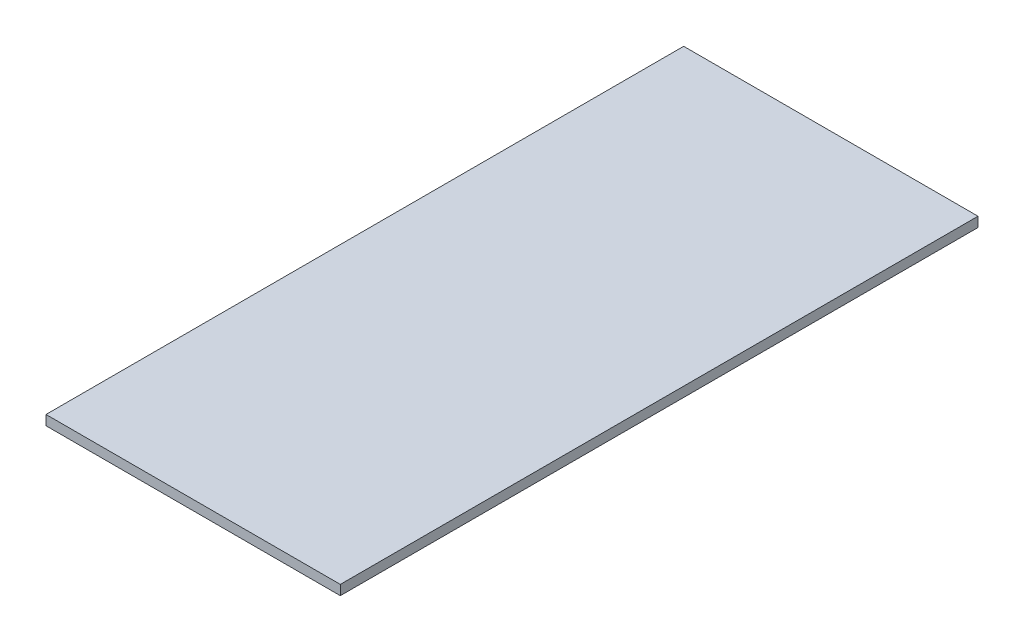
from build123d import *

# Parameters (mm, degrees)
SKETCH1_W           = 30
SKETCH1_H           = 65
BOSS_EXTRUDE1_DEPTH = 1


with BuildPart() as part:
    # Sketch1 → Boss-Extrude1 (new body)
    with BuildSketch(Plane(origin=(0, 0, 0), x_dir=(1, 0, 0), z_dir=(0, 1, 0))):
        with Locations((15, 32.5)):
            Rectangle(SKETCH1_W, SKETCH1_H)
    extrude(amount=BOSS_EXTRUDE1_DEPTH)


solid = part.part
